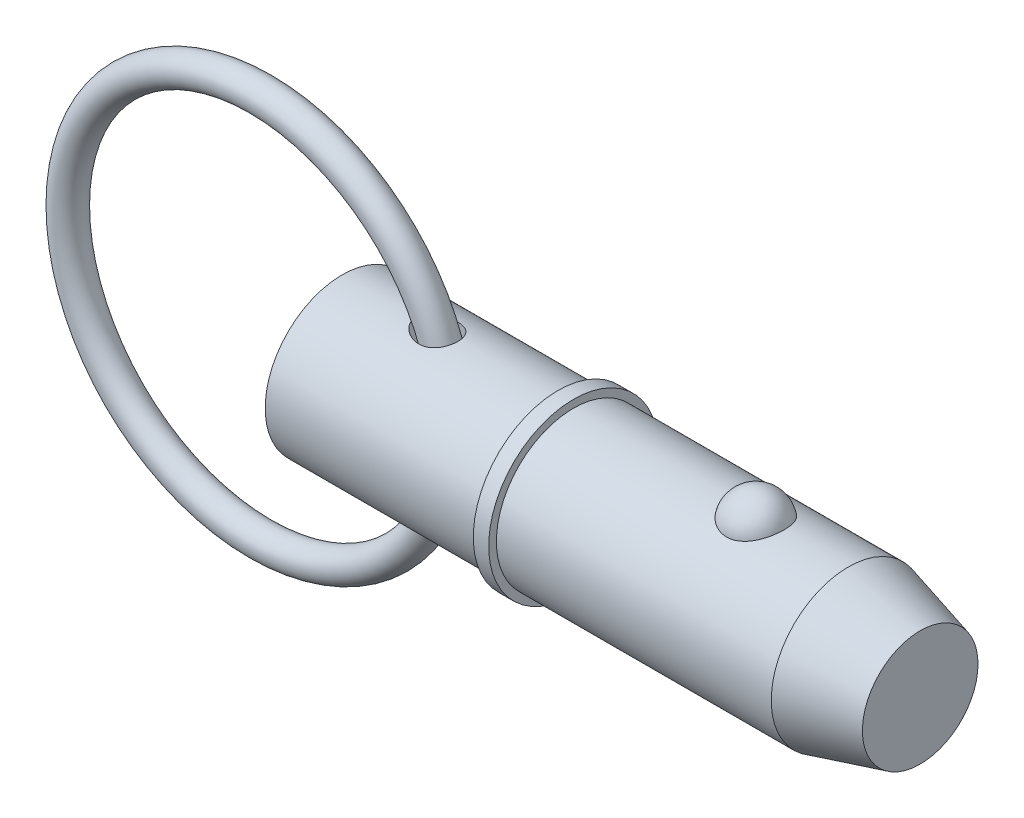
ISO-10303-21;
HEADER;
FILE_DESCRIPTION(('STEP AP214'),'2;1');
FILE_NAME('part.step','',(''),(''),'','','');
FILE_SCHEMA(('AUTOMOTIVE_DESIGN { 1 0 10303 214 1 1 1 1 }'));
ENDSEC;
DATA;
#1=APPLICATION_CONTEXT('core data for automotive mechanical design processes');
#2=APPLICATION_PROTOCOL_DEFINITION('international standard','automotive_design',2000,#1);
#3=PRODUCT_CONTEXT('',#1,'mechanical');
#4=PRODUCT('Part','Part','',(#3));
#5=PRODUCT_RELATED_PRODUCT_CATEGORY('part','',(#4));
#6=PRODUCT_DEFINITION_FORMATION('','',#4);
#7=PRODUCT_DEFINITION_CONTEXT('part definition',#1,'design');
#8=PRODUCT_DEFINITION('design','',#6,#7);
#9=PRODUCT_DEFINITION_SHAPE('','',#8);
#10=(LENGTH_UNIT() NAMED_UNIT(*) SI_UNIT(.MILLI.,.METRE.));
#11=(NAMED_UNIT(*) PLANE_ANGLE_UNIT() SI_UNIT($,.RADIAN.));
#12=(NAMED_UNIT(*) SI_UNIT($,.STERADIAN.) SOLID_ANGLE_UNIT());
#13=UNCERTAINTY_MEASURE_WITH_UNIT(LENGTH_MEASURE(1.E-05),#10,'distance_accuracy_value','');
#14=(GEOMETRIC_REPRESENTATION_CONTEXT(3) GLOBAL_UNCERTAINTY_ASSIGNED_CONTEXT((#13)) GLOBAL_UNIT_ASSIGNED_CONTEXT((#10,
#11,#12)) REPRESENTATION_CONTEXT('',''));
#15=CARTESIAN_POINT('',(0.,0.,0.));
#16=DIRECTION('',(0.,0.,1.));
#17=DIRECTION('',(1.,0.,0.));
#18=AXIS2_PLACEMENT_3D('',#15,#16,#17);
#19=CARTESIAN_POINT('',(-13.4840686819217,0.,0.));
#20=DIRECTION('',(0.,0.,1.));
#21=DIRECTION('',(1.,0.,0.));
#22=AXIS2_PLACEMENT_3D('',#19,#20,#21);
#23=TOROIDAL_SURFACE('',#22,31.75,2.54);
#24=CARTESIAN_POINT('',(20.8059313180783,0.,0.));
#25=VERTEX_POINT('',#24);
#26=VERTEX_LOOP('',#25);
#27=FACE_BOUND('',#26,.T.);
#28=ADVANCED_FACE('P0_F12',(#27),#23,.T.);
#29=CLOSED_SHELL('',(#28));
#30=MANIFOLD_SOLID_BREP('P0_B1',#29);
#31=CARTESIAN_POINT('',(0.,0.,0.));
#32=DIRECTION('',(1.,0.,0.));
#33=DIRECTION('',(0.,0.,-1.));
#34=AXIS2_PLACEMENT_3D('',#31,#32,#33);
#35=CYLINDRICAL_SURFACE('',#34,12.7);
#36=CARTESIAN_POINT('',(13.092900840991,12.5230976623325,-2.11234992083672));
#37=CARTESIAN_POINT('',(13.2535855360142,12.4976398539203,-2.26328363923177));
#38=CARTESIAN_POINT('',(13.4280602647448,12.4718592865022,-2.3995578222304));
#39=CARTESIAN_POINT('',(13.7976341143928,12.4229301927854,-2.64122157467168));
#40=CARTESIAN_POINT('',(13.9927568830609,12.3997847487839,-2.74657519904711));
#41=CARTESIAN_POINT('',(14.397672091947,12.3590534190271,-2.92439761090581));
#42=CARTESIAN_POINT('',(14.6074445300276,12.3414601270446,-2.99691026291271));
#43=CARTESIAN_POINT('',(15.0366557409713,12.3142893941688,-3.10669649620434));
#44=CARTESIAN_POINT('',(15.2560902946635,12.3047084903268,-3.14398530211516));
#45=CARTESIAN_POINT('',(15.5877843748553,12.2976819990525,-3.17128282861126));
#46=CARTESIAN_POINT('',(15.6989364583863,12.2965677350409,-3.17559470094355));
#47=CARTESIAN_POINT('',(15.9211629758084,12.2969101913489,-3.17427486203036));
#48=CARTESIAN_POINT('',(16.0322374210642,12.2983656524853,-3.16864802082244));
#49=CARTESIAN_POINT('',(16.2532861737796,12.3038832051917,-3.14715368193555));
#50=CARTESIAN_POINT('',(16.363260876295,12.3079443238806,-3.13129000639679));
#51=CARTESIAN_POINT('',(16.5810669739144,12.3185954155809,-3.08912320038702));
#52=CARTESIAN_POINT('',(16.6888986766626,12.3251850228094,-3.06282157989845));
#53=CARTESIAN_POINT('',(16.8894247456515,12.3398294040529,-3.00323791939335));
#54=CARTESIAN_POINT('',(16.9824664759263,12.3476389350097,-2.97106098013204));
#55=CARTESIAN_POINT('',(17.1651267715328,12.3648759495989,-2.89848824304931));
#56=CARTESIAN_POINT('',(17.2547457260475,12.3743032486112,-2.85809338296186));
#57=CARTESIAN_POINT('',(17.4297224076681,12.3944822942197,-2.76927391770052));
#58=CARTESIAN_POINT('',(17.5150817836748,12.40523352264,-2.72085245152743));
#59=CARTESIAN_POINT('',(17.6807665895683,12.4277046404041,-2.61629867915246));
#60=CARTESIAN_POINT('',(17.7610923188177,12.4394244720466,-2.56016683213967));
#61=CARTESIAN_POINT('',(17.9797287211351,12.4733252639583,-2.39133767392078));
#62=CARTESIAN_POINT('',(18.1114611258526,12.4961902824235,-2.27005507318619));
#63=CARTESIAN_POINT('',(18.3518677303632,12.5412050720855,-2.00648954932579));
#64=CARTESIAN_POINT('',(18.4605454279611,12.5633549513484,-1.86420981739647));
#65=CARTESIAN_POINT('',(18.6498843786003,12.6039384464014,-1.56614816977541));
#66=CARTESIAN_POINT('',(18.7311185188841,12.622444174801,-1.41073996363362));
#67=CARTESIAN_POINT('',(18.8669149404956,12.6543302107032,-1.08819514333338));
#68=CARTESIAN_POINT('',(18.921477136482,12.6677105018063,-0.921058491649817));
#69=CARTESIAN_POINT('',(19.0028875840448,12.6879542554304,-0.579029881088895));
#70=CARTESIAN_POINT('',(19.0296164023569,12.6947896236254,-0.404107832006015));
#71=CARTESIAN_POINT('',(19.0543673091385,12.7011128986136,-0.0521104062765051));
#72=CARTESIAN_POINT('',(19.0523885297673,12.7006005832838,0.124965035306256));
#73=CARTESIAN_POINT('',(19.019700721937,12.692266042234,0.476969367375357));
#74=CARTESIAN_POINT('',(18.9888798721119,12.6844153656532,0.651887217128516));
#75=CARTESIAN_POINT('',(18.8990221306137,12.6622099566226,0.99389064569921));
#76=CARTESIAN_POINT('',(18.839985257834,12.6478552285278,1.16097622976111));
#77=CARTESIAN_POINT('',(18.6951419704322,12.6142309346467,1.48231767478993));
#78=CARTESIAN_POINT('',(18.6093706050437,12.5949678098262,1.63659000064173));
#79=CARTESIAN_POINT('',(18.4131352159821,12.5536490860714,1.92810749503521));
#80=CARTESIAN_POINT('',(18.3026732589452,12.5315937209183,2.06535408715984));
#81=CARTESIAN_POINT('',(18.060669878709,12.4872833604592,2.31822774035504));
#82=CARTESIAN_POINT('',(17.9292520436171,12.4650302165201,2.43397343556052));
#83=CARTESIAN_POINT('',(17.6485957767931,12.4226514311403,2.64178289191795));
#84=CARTESIAN_POINT('',(17.4993587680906,12.4025256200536,2.73384854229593));
#85=CARTESIAN_POINT('',(17.1869531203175,12.3664726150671,2.8925825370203));
#86=CARTESIAN_POINT('',(17.0237450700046,12.3505578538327,2.95917592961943));
#87=CARTESIAN_POINT('',(16.6884731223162,12.3245177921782,3.06582547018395));
#88=CARTESIAN_POINT('',(16.516407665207,12.3143935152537,3.10587692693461));
#89=CARTESIAN_POINT('',(16.1604213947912,12.3003788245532,3.16093927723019));
#90=CARTESIAN_POINT('',(15.9763106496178,12.2967791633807,3.17478342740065));
#91=CARTESIAN_POINT('',(15.6080973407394,12.2966663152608,3.17521180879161));
#92=CARTESIAN_POINT('',(15.4239948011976,12.3001555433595,3.16178674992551));
#93=CARTESIAN_POINT('',(15.0417156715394,12.3141744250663,3.10676725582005));
#94=CARTESIAN_POINT('',(14.8439465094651,12.3253658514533,3.06251977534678));
#95=CARTESIAN_POINT('',(14.4574652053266,12.3538942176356,2.94531863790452));
#96=CARTESIAN_POINT('',(14.2687614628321,12.3712367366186,2.87233891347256));
#97=CARTESIAN_POINT('',(13.8856104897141,12.4121323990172,2.69045747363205));
#98=CARTESIAN_POINT('',(13.6926012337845,12.4361434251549,2.57861276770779));
#99=CARTESIAN_POINT('',(13.328588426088,12.4862632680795,2.32379935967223));
#100=CARTESIAN_POINT('',(13.1575718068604,12.5123708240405,2.18084927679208));
#101=CARTESIAN_POINT('',(12.8776146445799,12.5579467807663,1.89840233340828));
#102=CARTESIAN_POINT('',(12.7631663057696,12.5776642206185,1.76440341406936));
#103=CARTESIAN_POINT('',(12.5574911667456,12.6143643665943,1.47931295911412));
#104=CARTESIAN_POINT('',(12.4662309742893,12.6313509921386,1.32824646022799));
#105=CARTESIAN_POINT('',(12.3240650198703,12.6583901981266,1.03598403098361));
#106=CARTESIAN_POINT('',(12.2691183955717,12.6691064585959,0.896822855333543));
#107=CARTESIAN_POINT('',(12.1828741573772,12.6860954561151,0.611068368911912));
#108=CARTESIAN_POINT('',(12.1515620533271,12.6923709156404,0.464479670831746));
#109=CARTESIAN_POINT('',(12.1147168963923,12.6997676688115,0.167420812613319));
#110=CARTESIAN_POINT('',(12.1092708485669,12.7008715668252,0.0169392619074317));
#111=CARTESIAN_POINT('',(12.1248234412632,12.6977391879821,-0.282592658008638));
#112=CARTESIAN_POINT('',(12.1458245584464,12.6935024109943,-0.431642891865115));
#113=CARTESIAN_POINT('',(12.210908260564,12.6805581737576,-0.716008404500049));
#114=CARTESIAN_POINT('',(12.2537133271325,12.6720986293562,-0.851633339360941));
#115=CARTESIAN_POINT('',(12.3591295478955,12.6516826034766,-1.11460776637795));
#116=CARTESIAN_POINT('',(12.4217455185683,12.6397252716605,-1.24195523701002));
#117=CARTESIAN_POINT('',(12.5735635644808,12.61152213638,-1.50300095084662));
#118=CARTESIAN_POINT('',(12.6652159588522,12.5949150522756,-1.63522875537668));
#119=CARTESIAN_POINT('',(12.8664347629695,12.5599626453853,-1.88501670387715));
#120=CARTESIAN_POINT('',(12.9760196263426,12.541615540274,-2.0025615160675));
#121=CARTESIAN_POINT('',(13.092900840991,12.5230976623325,-2.11234992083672));
#122=B_SPLINE_CURVE_WITH_KNOTS('',3,(#36,#37,#38,#39,#40,#41,#42,#43,#44,#45,#46,#47,#48,#49,
#50,#51,#52,#53,#54,#55,#56,#57,#58,#59,#60,#61,#62,#63,#64,#65,#66,#67,#68,#69,#70,#71,#72,#73,
#74,#75,#76,#77,#78,#79,#80,#81,#82,#83,#84,#85,#86,#87,#88,#89,#90,#91,#92,#93,#94,#95,#96,#97,
#98,#99,#100,#101,#102,#103,#104,#105,#106,#107,#108,#109,#110,#111,#112,#113,#114,#115,#116,
#117,#118,#119,#120,#121),.UNSPECIFIED.,.T.,.F.,(4,2,2,2,2,2,2,2,2,2,2,2,2,2,2,2,2,2,2,2,2,2,2,
2,2,2,2,2,2,2,2,2,2,2,2,2,2,2,2,2,2,2,4),(0.,0.665132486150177,1.33103515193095,
1.99604575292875,2.66076878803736,2.99410229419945,3.32727250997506,3.66031840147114,
3.99331613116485,4.28918991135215,4.58502994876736,4.88075456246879,5.17646157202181,
5.71510826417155,6.2536731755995,6.78017774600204,7.30668400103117,7.83544030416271,
8.36421259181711,8.89504347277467,9.42587399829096,9.95601150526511,10.4861046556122,
11.0131799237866,11.5402131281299,12.0687854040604,12.5974510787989,13.1491450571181,
13.7010270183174,14.3074556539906,14.914435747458,15.5844380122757,16.2540403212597,
16.7839879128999,17.3131679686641,17.7612578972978,18.2090728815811,18.658393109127,
19.1077554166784,19.5333866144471,19.959121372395,20.4424347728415,20.9262486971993),.UNSPECIFIED.);
#123=CARTESIAN_POINT('',(13.092900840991,12.5230976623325,-2.11234992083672));
#124=VERTEX_POINT('',#123);
#125=EDGE_CURVE('P1_E42',#124,#124,#122,.T.);
#126=ORIENTED_EDGE('',*,*,#125,.T.);
#127=EDGE_LOOP('',(#126));
#128=FACE_BOUND('',#127,.T.);
#129=CARTESIAN_POINT('',(0.,0.,0.));
#130=DIRECTION('',(1.,0.,0.));
#131=DIRECTION('',(0.,0.,-1.));
#132=AXIS2_PLACEMENT_3D('',#129,#130,#131);
#133=CIRCLE('',#132,12.7);
#134=CARTESIAN_POINT('',(0.,0.,-12.7));
#135=VERTEX_POINT('',#134);
#136=EDGE_CURVE('P1_E9',#135,#135,#133,.T.);
#137=ORIENTED_EDGE('',*,*,#136,.T.);
#138=EDGE_LOOP('',(#137));
#139=FACE_BOUND('',#138,.T.);
#140=CARTESIAN_POINT('',(35.56,0.,0.));
#141=DIRECTION('',(1.,0.,0.));
#142=DIRECTION('',(0.,0.,-1.));
#143=AXIS2_PLACEMENT_3D('',#140,#141,#142);
#144=CIRCLE('',#143,12.7);
#145=CARTESIAN_POINT('',(35.56,0.,-12.7));
#146=VERTEX_POINT('',#145);
#147=EDGE_CURVE('P1_E25',#146,#146,#144,.T.);
#148=ORIENTED_EDGE('',*,*,#147,.F.);
#149=EDGE_LOOP('',(#148));
#150=FACE_BOUND('',#149,.T.);
#151=CARTESIAN_POINT('',(13.092900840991,-12.5230976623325,-2.11234992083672));
#152=CARTESIAN_POINT('',(12.9659872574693,-12.5432050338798,-1.99314161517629));
#153=CARTESIAN_POINT('',(12.847667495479,-12.5631124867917,-1.86478966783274));
#154=CARTESIAN_POINT('',(12.6324721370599,-12.6007427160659,-1.59069749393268));
#155=CARTESIAN_POINT('',(12.5355833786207,-12.6184668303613,-1.444968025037));
#156=CARTESIAN_POINT('',(12.409907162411,-12.642034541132,-1.21450950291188));
#157=CARTESIAN_POINT('',(12.3711427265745,-12.6494175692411,-1.13527163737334));
#158=CARTESIAN_POINT('',(12.3010994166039,-12.6628962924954,-0.973464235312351));
#159=CARTESIAN_POINT('',(12.2698164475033,-12.6689926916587,-0.890896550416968));
#160=CARTESIAN_POINT('',(12.2153933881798,-12.6796767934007,-0.723090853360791));
#161=CARTESIAN_POINT('',(12.192246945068,-12.6842656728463,-0.637854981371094));
#162=CARTESIAN_POINT('',(12.154603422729,-12.6917620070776,-0.465421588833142));
#163=CARTESIAN_POINT('',(12.1401047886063,-12.69466976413,-0.378224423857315));
#164=CARTESIAN_POINT('',(12.1214471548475,-12.6984180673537,-0.214417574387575));
#165=CARTESIAN_POINT('',(12.1161713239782,-12.699481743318,-0.137938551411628));
#166=CARTESIAN_POINT('',(12.1124989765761,-12.7002217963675,0.0152189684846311));
#167=CARTESIAN_POINT('',(12.1141046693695,-12.6998977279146,0.0918975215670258));
#168=CARTESIAN_POINT('',(12.1241695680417,-12.6978712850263,0.24474645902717));
#169=CARTESIAN_POINT('',(12.132625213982,-12.6961696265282,0.320917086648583));
#170=CARTESIAN_POINT('',(12.1562110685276,-12.6914452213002,0.472185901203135));
#171=CARTESIAN_POINT('',(12.1713438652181,-12.6884219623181,0.547283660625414));
#172=CARTESIAN_POINT('',(12.223731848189,-12.6780227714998,0.759415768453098));
#173=CARTESIAN_POINT('',(12.268839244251,-12.6691353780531,0.894507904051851));
#174=CARTESIAN_POINT('',(12.3786059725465,-12.6479567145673,1.1560647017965));
#175=CARTESIAN_POINT('',(12.4432700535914,-12.6356646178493,1.28252725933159));
#176=CARTESIAN_POINT('',(12.5971341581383,-12.607236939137,1.5381272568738));
#177=CARTESIAN_POINT('',(12.6882234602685,-12.5908303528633,1.66609325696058));
#178=CARTESIAN_POINT('',(12.887209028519,-12.5564642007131,1.90792082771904));
#179=CARTESIAN_POINT('',(12.995115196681,-12.5385037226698,2.02177401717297));
#180=CARTESIAN_POINT('',(13.2471335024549,-12.4987806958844,2.25547266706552));
#181=CARTESIAN_POINT('',(13.3941979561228,-12.4769622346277,2.3721269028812));
#182=CARTESIAN_POINT('',(13.7036983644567,-12.4349587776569,2.58329351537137));
#183=CARTESIAN_POINT('',(13.8661464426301,-12.4147750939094,2.67778822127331));
#184=CARTESIAN_POINT('',(14.2306024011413,-12.3748157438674,2.85722657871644));
#185=CARTESIAN_POINT('',(14.4347220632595,-12.3556533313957,2.93804226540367));
#186=CARTESIAN_POINT('',(14.8540416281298,-12.3245430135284,3.06594877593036));
#187=CARTESIAN_POINT('',(15.0692453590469,-12.3125976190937,3.11302786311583));
#188=CARTESIAN_POINT('',(15.3981213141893,-12.3014943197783,3.15648626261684));
#189=CARTESIAN_POINT('',(15.5100235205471,-12.298940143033,3.16639841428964));
#190=CARTESIAN_POINT('',(15.7342812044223,-12.2963942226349,3.17627668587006));
#191=CARTESIAN_POINT('',(15.8466364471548,-12.2964012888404,3.1762474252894));
#192=CARTESIAN_POINT('',(16.0707903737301,-12.2990694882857,3.16589868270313));
#193=CARTESIAN_POINT('',(16.1825892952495,-12.3017293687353,3.1555840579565));
#194=CARTESIAN_POINT('',(16.4046123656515,-12.3096862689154,3.12440163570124));
#195=CARTESIAN_POINT('',(16.514836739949,-12.314982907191,3.10353536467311));
#196=CARTESIAN_POINT('',(16.7211934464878,-12.3273933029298,3.05384263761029));
#197=CARTESIAN_POINT('',(16.8175961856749,-12.3342598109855,3.0260738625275));
#198=CARTESIAN_POINT('',(17.0073515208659,-12.3498131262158,2.96195947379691));
#199=CARTESIAN_POINT('',(17.100704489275,-12.3584997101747,2.92561491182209));
#200=CARTESIAN_POINT('',(17.2834584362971,-12.3774243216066,2.84448580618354));
#201=CARTESIAN_POINT('',(17.3728610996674,-12.3876616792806,2.79970490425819));
#202=CARTESIAN_POINT('',(17.5469061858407,-12.409352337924,2.701939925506));
#203=CARTESIAN_POINT('',(17.6315489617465,-12.4208055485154,2.64895645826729));
#204=CARTESIAN_POINT('',(17.7872886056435,-12.4433734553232,2.54070972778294));
#205=CARTESIAN_POINT('',(17.8589017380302,-12.4544123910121,2.48617167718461));
#206=CARTESIAN_POINT('',(17.9970802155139,-12.4768404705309,2.37105291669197));
#207=CARTESIAN_POINT('',(18.063643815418,-12.4882297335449,2.31047013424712));
#208=CARTESIAN_POINT('',(18.1911677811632,-12.5110137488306,2.18372894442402));
#209=CARTESIAN_POINT('',(18.2521311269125,-12.5224084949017,2.11757353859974));
#210=CARTESIAN_POINT('',(18.3680676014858,-12.5448751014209,1.98014449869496));
#211=CARTESIAN_POINT('',(18.4230385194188,-12.5559468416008,1.90886899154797));
#212=CARTESIAN_POINT('',(18.5752306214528,-12.5875288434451,1.69257698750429));
#213=CARTESIAN_POINT('',(18.6637018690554,-12.6071482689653,1.54111740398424));
#214=CARTESIAN_POINT('',(18.8143485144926,-12.6417556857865,1.225260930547));
#215=CARTESIAN_POINT('',(18.876524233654,-12.6567437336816,1.06086419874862));
#216=CARTESIAN_POINT('',(18.9733884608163,-12.6805238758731,0.723195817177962));
#217=CARTESIAN_POINT('',(19.0079967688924,-12.6892978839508,0.549899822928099));
#218=CARTESIAN_POINT('',(19.0486500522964,-12.6996362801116,0.199781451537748));
#219=CARTESIAN_POINT('',(19.054694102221,-12.7012004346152,0.0229589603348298));
#220=CARTESIAN_POINT('',(19.0380549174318,-12.6969431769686,-0.330044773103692));
#221=CARTESIAN_POINT('',(19.0152419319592,-12.6910884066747,-0.506219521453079));
#222=CARTESIAN_POINT('',(18.9411599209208,-12.672565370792,-0.852112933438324));
#223=CARTESIAN_POINT('',(18.8898907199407,-12.659897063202,-1.0218315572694));
#224=CARTESIAN_POINT('',(18.7600888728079,-12.6291327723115,-1.34987035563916));
#225=CARTESIAN_POINT('',(18.6815715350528,-12.6110398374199,-1.50819687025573));
#226=CARTESIAN_POINT('',(18.4991526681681,-12.5714188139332,-1.808997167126));
#227=CARTESIAN_POINT('',(18.3952529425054,-12.5498909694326,-1.95147207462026));
#228=CARTESIAN_POINT('',(18.1653806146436,-12.5059234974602,-2.21580059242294));
#229=CARTESIAN_POINT('',(18.0395297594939,-12.4834893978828,-2.33776101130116));
#230=CARTESIAN_POINT('',(17.7688701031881,-12.4400863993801,-2.55870399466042));
#231=CARTESIAN_POINT('',(17.6240631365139,-12.4191173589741,-2.65768878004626));
#232=CARTESIAN_POINT('',(17.3196803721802,-12.380896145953,-2.8304192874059));
#233=CARTESIAN_POINT('',(17.1601036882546,-12.3636441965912,-2.90416349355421));
#234=CARTESIAN_POINT('',(16.8308162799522,-12.3345597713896,-3.02531546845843));
#235=CARTESIAN_POINT('',(16.6611041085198,-12.322728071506,-3.07271946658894));
#236=CARTESIAN_POINT('',(16.3099674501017,-12.3051318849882,-3.14246490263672));
#237=CARTESIAN_POINT('',(16.1283412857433,-12.2996014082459,-3.16384159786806));
#238=CARTESIAN_POINT('',(15.7639014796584,-12.2955807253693,-3.17942379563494));
#239=CARTESIAN_POINT('',(15.5810875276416,-12.2970924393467,-3.17362188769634));
#240=CARTESIAN_POINT('',(15.20154276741,-12.307074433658,-3.13470416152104));
#241=CARTESIAN_POINT('',(15.0050835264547,-12.316173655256,-3.09911848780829));
#242=CARTESIAN_POINT('',(14.6197996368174,-12.3407987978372,-2.99954607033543));
#243=CARTESIAN_POINT('',(14.4309834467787,-12.3563316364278,-2.93552875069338));
#244=CARTESIAN_POINT('',(14.0353751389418,-12.3949378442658,-2.76840280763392));
#245=CARTESIAN_POINT('',(13.8306109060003,-12.4188242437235,-2.66064798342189));
#246=CARTESIAN_POINT('',(13.4432099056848,-12.4696241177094,-2.4113475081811));
#247=CARTESIAN_POINT('',(13.2605568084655,-12.4965353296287,-2.26982702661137));
#248=CARTESIAN_POINT('',(13.092900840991,-12.5230976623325,-2.11234992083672));
#249=B_SPLINE_CURVE_WITH_KNOTS('',3,(#151,#152,#153,#154,#155,#156,#157,#158,#159,#160,#161,
#162,#163,#164,#165,#166,#167,#168,#169,#170,#171,#172,#173,#174,#175,#176,#177,#178,#179,#180,
#181,#182,#183,#184,#185,#186,#187,#188,#189,#190,#191,#192,#193,#194,#195,#196,#197,#198,#199,
#200,#201,#202,#203,#204,#205,#206,#207,#208,#209,#210,#211,#212,#213,#214,#215,#216,#217,#218,
#219,#220,#221,#222,#223,#224,#225,#226,#227,#228,#229,#230,#231,#232,#233,#234,#235,#236,#237,
#238,#239,#240,#241,#242,#243,#244,#245,#246,#247,#248),.UNSPECIFIED.,.T.,.F.,(4,2,2,2,2,2,2,2,
2,2,2,2,2,2,2,2,2,2,2,2,2,2,2,2,2,2,2,2,2,2,2,2,2,2,2,2,2,2,2,2,2,2,2,2,2,2,2,2,4),(0.,
0.525289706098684,1.05025590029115,1.31549608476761,1.58059075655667,1.84547798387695,
2.11031756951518,2.34000998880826,2.56977615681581,2.79942299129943,3.0291589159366,
3.45531787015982,3.8815803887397,4.35362362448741,4.82594586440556,5.39074449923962,
5.95599200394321,6.61421946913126,7.27267581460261,7.60939383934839,7.9459554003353,
8.2823580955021,8.61871213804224,8.91997243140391,9.22119579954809,9.52228943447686,
9.82336070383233,10.0950952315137,10.3669232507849,10.6386057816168,10.9103882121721,
11.4371688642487,11.9639430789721,12.4922442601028,13.0205625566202,13.5512648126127,
14.0819703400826,14.6123781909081,15.1427483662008,15.6702654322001,16.1977314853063,
16.7252292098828,17.2528024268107,17.7993878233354,18.3461222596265,18.9432829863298,
19.541087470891,20.2355241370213,20.9294447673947),.UNSPECIFIED.);
#250=CARTESIAN_POINT('',(13.092900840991,-12.5230976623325,-2.11234992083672));
#251=VERTEX_POINT('',#250);
#252=EDGE_CURVE('P1_E17',#251,#251,#249,.T.);
#253=ORIENTED_EDGE('',*,*,#252,.T.);
#254=EDGE_LOOP('',(#253));
#255=FACE_BOUND('',#254,.T.);
#256=ADVANCED_FACE('P1_F13',(#128,#139,#150,#255),#35,.T.);
#257=CARTESIAN_POINT('',(0.,0.,0.));
#258=DIRECTION('',(1.,0.,0.));
#259=DIRECTION('',(0.,0.,-1.));
#260=AXIS2_PLACEMENT_3D('',#257,#258,#259);
#261=CYLINDRICAL_SURFACE('',#260,12.7);
#262=CARTESIAN_POINT('',(83.4007386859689,0.,0.));
#263=DIRECTION('',(1.,0.,0.));
#264=DIRECTION('',(0.,0.,-1.));
#265=AXIS2_PLACEMENT_3D('',#262,#263,#264);
#266=CIRCLE('',#265,12.7);
#267=CARTESIAN_POINT('',(83.4007386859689,0.,-12.7));
#268=VERTEX_POINT('',#267);
#269=EDGE_CURVE('P1_E99',#268,#268,#266,.T.);
#270=ORIENTED_EDGE('',*,*,#269,.F.);
#271=EDGE_LOOP('',(#270));
#272=FACE_BOUND('',#271,.T.);
#273=CARTESIAN_POINT('',(38.1,0.,0.));
#274=DIRECTION('',(1.,0.,0.));
#275=DIRECTION('',(0.,0.,-1.));
#276=AXIS2_PLACEMENT_3D('',#273,#274,#275);
#277=CIRCLE('',#276,12.7);
#278=CARTESIAN_POINT('',(38.1,0.,-12.7));
#279=VERTEX_POINT('',#278);
#280=EDGE_CURVE('P1_E96',#279,#279,#277,.T.);
#281=ORIENTED_EDGE('',*,*,#280,.T.);
#282=EDGE_LOOP('',(#281));
#283=FACE_BOUND('',#282,.T.);
#284=CARTESIAN_POINT('',(68.1600429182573,11.7500437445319,4.81938502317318));
#285=CARTESIAN_POINT('',(68.0350881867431,11.7500430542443,4.81938571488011));
#286=CARTESIAN_POINT('',(67.910144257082,11.7520975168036,4.81438658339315));
#287=CARTESIAN_POINT('',(67.6611425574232,11.760253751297,4.79442904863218));
#288=CARTESIAN_POINT('',(67.5370850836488,11.7663568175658,4.77946746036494));
#289=CARTESIAN_POINT('',(67.2909016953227,11.7824262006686,4.7397141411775));
#290=CARTESIAN_POINT('',(67.1687744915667,11.7923898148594,4.71492928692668));
#291=CARTESIAN_POINT('',(66.9271874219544,11.8158938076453,4.65571340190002));
#292=CARTESIAN_POINT('',(66.8077285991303,11.8294355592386,4.6212786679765));
#293=CARTESIAN_POINT('',(66.5725578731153,11.8596812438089,4.54309502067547));
#294=CARTESIAN_POINT('',(66.4568393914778,11.8763792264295,4.49936361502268));
#295=CARTESIAN_POINT('',(66.2296530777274,11.9124878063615,4.40287235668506));
#296=CARTESIAN_POINT('',(66.1181868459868,11.9318994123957,4.35010914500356));
#297=CARTESIAN_POINT('',(65.7912782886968,11.9934256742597,4.17881316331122));
#298=CARTESIAN_POINT('',(65.5831270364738,12.038858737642,4.04720756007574));
#299=CARTESIAN_POINT('',(65.1858509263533,12.1352173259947,3.748564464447));
#300=CARTESIAN_POINT('',(64.9974438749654,12.1862630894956,3.58061821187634));
#301=CARTESIAN_POINT('',(64.6505213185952,12.2875163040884,3.21600758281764));
#302=CARTESIAN_POINT('',(64.4920113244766,12.3377235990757,3.0193379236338));
#303=CARTESIAN_POINT('',(64.2016887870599,12.434492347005,2.592916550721));
#304=CARTESIAN_POINT('',(64.0713762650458,12.4807925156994,2.36208286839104));
#305=CARTESIAN_POINT('',(63.8494079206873,12.5623454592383,1.88070399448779));
#306=CARTESIAN_POINT('',(63.7577554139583,12.5975972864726,1.63015711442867));
#307=CARTESIAN_POINT('',(63.6140466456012,12.6538414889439,1.1129886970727));
#308=CARTESIAN_POINT('',(63.5624990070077,12.6746503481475,0.846205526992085));
#309=CARTESIAN_POINT('',(63.5019771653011,12.699153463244,0.307085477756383));
#310=CARTESIAN_POINT('',(63.4930018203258,12.7028481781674,0.0347487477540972));
#311=CARTESIAN_POINT('',(63.5177310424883,12.6927785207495,-0.506073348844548));
#312=CARTESIAN_POINT('',(63.5511899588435,12.6791146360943,-0.77457186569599));
#313=CARTESIAN_POINT('',(63.6596877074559,12.635882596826,-1.30170246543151));
#314=CARTESIAN_POINT('',(63.7347272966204,12.606314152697,-1.5603343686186));
#315=CARTESIAN_POINT('',(63.9250000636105,12.5342328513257,-2.06083899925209));
#316=CARTESIAN_POINT('',(64.0402872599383,12.4917026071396,-2.3026886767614));
#317=CARTESIAN_POINT('',(64.3087044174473,12.3981123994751,-2.76259600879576));
#318=CARTESIAN_POINT('',(64.4618374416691,12.3470517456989,-2.98065173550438));
#319=CARTESIAN_POINT('',(64.8035077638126,12.2416045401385,-3.38786328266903));
#320=CARTESIAN_POINT('',(64.9922017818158,12.1872040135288,-3.57688418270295));
#321=CARTESIAN_POINT('',(65.4002392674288,12.0814086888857,-3.91941073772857));
#322=CARTESIAN_POINT('',(65.6195800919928,12.0300136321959,-4.07291945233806));
#323=CARTESIAN_POINT('',(66.0783753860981,11.9373542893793,-4.33691289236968));
#324=CARTESIAN_POINT('',(66.3173044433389,11.8958982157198,-4.44824125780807));
#325=CARTESIAN_POINT('',(66.8124376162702,11.8268116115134,-4.62881985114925));
#326=CARTESIAN_POINT('',(67.0686351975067,11.7991758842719,-4.69808589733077));
#327=CARTESIAN_POINT('',(67.5771640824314,11.7622209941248,-4.78983181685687));
#328=CARTESIAN_POINT('',(67.8290414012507,11.7520502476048,-4.81449025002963));
#329=CARTESIAN_POINT('',(68.3335734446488,11.7485796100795,-4.82295735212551));
#330=CARTESIAN_POINT('',(68.5862280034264,11.7552763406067,-4.80677420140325));
#331=CARTESIAN_POINT('',(69.0768341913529,11.7842584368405,-4.73525430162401));
#332=CARTESIAN_POINT('',(69.3149984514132,11.8060486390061,-4.68116061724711));
#333=CARTESIAN_POINT('',(69.7784894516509,11.8622750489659,-4.53678133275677));
#334=CARTESIAN_POINT('',(70.0038151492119,11.8967122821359,-4.44649279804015));
#335=CARTESIAN_POINT('',(70.4408018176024,11.9754603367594,-4.2298761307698));
#336=CARTESIAN_POINT('',(70.6520579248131,12.0199699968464,-4.10280539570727));
#337=CARTESIAN_POINT('',(71.0506012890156,12.1138028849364,-3.81685409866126));
#338=CARTESIAN_POINT('',(71.2378830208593,12.163127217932,-3.65796622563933));
#339=CARTESIAN_POINT('',(71.5933509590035,12.2642343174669,-3.30364864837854));
#340=CARTESIAN_POINT('',(71.7601119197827,12.3160165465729,-3.10678783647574));
#341=CARTESIAN_POINT('',(72.0595799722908,12.4142566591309,-2.68748409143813));
#342=CARTESIAN_POINT('',(72.1922809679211,12.4607135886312,-2.46503658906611));
#343=CARTESIAN_POINT('',(72.4246912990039,12.5450236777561,-1.99289519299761));
#344=CARTESIAN_POINT('',(72.523215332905,12.5825557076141,-1.74255918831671));
#345=CARTESIAN_POINT('',(72.6792277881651,12.6431720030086,-1.22773734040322));
#346=CARTESIAN_POINT('',(72.7367157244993,12.6662560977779,-0.963251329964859));
#347=CARTESIAN_POINT('',(72.8095441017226,12.6956486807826,-0.427355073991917));
#348=CARTESIAN_POINT('',(72.8248378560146,12.7019385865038,-0.1559374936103));
#349=CARTESIAN_POINT('',(72.8127794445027,12.6970201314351,0.385928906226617));
#350=CARTESIAN_POINT('',(72.7854280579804,12.6858120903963,0.656377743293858));
#351=CARTESIAN_POINT('',(72.7130609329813,12.6568455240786,1.05454017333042));
#352=CARTESIAN_POINT('',(72.6837963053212,12.6451962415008,1.18577850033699));
#353=CARTESIAN_POINT('',(72.6150228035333,12.6181819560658,1.4451380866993));
#354=CARTESIAN_POINT('',(72.5755176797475,12.6028183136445,1.57326046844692));
#355=CARTESIAN_POINT('',(72.4864397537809,12.5687547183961,1.82554978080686));
#356=CARTESIAN_POINT('',(72.4368627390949,12.5500533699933,1.9497150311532));
#357=CARTESIAN_POINT('',(72.3279211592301,12.5098093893,2.1931437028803));
#358=CARTESIAN_POINT('',(72.2685601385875,12.4882677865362,2.31240887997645));
#359=CARTESIAN_POINT('',(72.1399712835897,12.4427679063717,2.54593031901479));
#360=CARTESIAN_POINT('',(72.0706888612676,12.4187964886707,2.66015396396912));
#361=CARTESIAN_POINT('',(71.922903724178,12.3691892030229,2.88202659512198));
#362=CARTESIAN_POINT('',(71.8444044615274,12.3435539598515,2.98967802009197));
#363=CARTESIAN_POINT('',(71.6785502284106,12.2912955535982,3.19774385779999));
#364=CARTESIAN_POINT('',(71.5911918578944,12.2646720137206,3.29815546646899));
#365=CARTESIAN_POINT('',(71.4081617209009,12.2111945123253,3.49095035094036));
#366=CARTESIAN_POINT('',(71.3124932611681,12.1843406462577,3.58333679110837));
#367=CARTESIAN_POINT('',(71.1136272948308,12.1312249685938,3.75922876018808));
#368=CARTESIAN_POINT('',(71.0104503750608,12.104961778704,3.84275713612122));
#369=CARTESIAN_POINT('',(70.7970133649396,12.0537284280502,4.00056406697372));
#370=CARTESIAN_POINT('',(70.6867562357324,12.028757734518,4.07484645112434));
#371=CARTESIAN_POINT('',(70.4597550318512,11.9808306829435,4.21367959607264));
#372=CARTESIAN_POINT('',(70.3430068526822,11.9578756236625,4.27822410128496));
#373=CARTESIAN_POINT('',(70.1039425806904,11.9147184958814,4.39698483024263));
#374=CARTESIAN_POINT('',(69.9816287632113,11.894515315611,4.45120522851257));
#375=CARTESIAN_POINT('',(69.722952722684,11.8561129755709,4.55255353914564));
#376=CARTESIAN_POINT('',(69.5862237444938,11.8381764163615,4.59884858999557));
#377=CARTESIAN_POINT('',(69.3086087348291,11.8069093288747,4.67853897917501));
#378=CARTESIAN_POINT('',(69.1677245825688,11.7935767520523,4.71194005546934));
#379=CARTESIAN_POINT('',(68.8830944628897,11.7720277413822,4.76552188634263));
#380=CARTESIAN_POINT('',(68.7393488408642,11.7638106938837,4.78570422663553));
#381=CARTESIAN_POINT('',(68.4504114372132,11.7528195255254,4.81263433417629));
#382=CARTESIAN_POINT('',(68.3052198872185,11.7500445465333,4.81938421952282));
#383=CARTESIAN_POINT('',(68.1600429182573,11.7500437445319,4.81938502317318));
#384=B_SPLINE_CURVE_WITH_KNOTS('',3,(#284,#285,#286,#287,#288,#289,#290,#291,#292,#293,#294,
#295,#296,#297,#298,#299,#300,#301,#302,#303,#304,#305,#306,#307,#308,#309,#310,#311,#312,#313,
#314,#315,#316,#317,#318,#319,#320,#321,#322,#323,#324,#325,#326,#327,#328,#329,#330,#331,#332,
#333,#334,#335,#336,#337,#338,#339,#340,#341,#342,#343,#344,#345,#346,#347,#348,#349,#350,#351,
#352,#353,#354,#355,#356,#357,#358,#359,#360,#361,#362,#363,#364,#365,#366,#367,#368,#369,#370,
#371,#372,#373,#374,#375,#376,#377,#378,#379,#380,#381,#382,#383),.UNSPECIFIED.,.T.,.F.,(4,2,2,
2,2,2,2,2,2,2,2,2,2,2,2,2,2,2,2,2,2,2,2,2,2,2,2,2,2,2,2,2,2,2,2,2,2,2,2,2,2,2,2,2,2,2,2,2,2,4),
(0.,0.374729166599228,0.749578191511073,1.12416526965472,1.49889629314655,1.87292776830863,
2.24709865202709,2.99481328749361,3.76399449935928,4.53331735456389,5.3368391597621,
6.14042986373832,6.95405296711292,7.76765424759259,8.57656703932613,9.38549455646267,
10.1955119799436,11.0055949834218,11.8193353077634,12.6330054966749,13.4294141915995,
14.2255231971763,14.9815786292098,15.7374826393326,16.4696948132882,17.2019663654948,
17.9501979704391,18.6986017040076,19.484470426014,20.2704797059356,21.0815215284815,
21.8925729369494,22.7045213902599,23.5164550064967,23.9209608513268,24.3253187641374,
24.7298461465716,25.1342272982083,25.54092555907,25.9474719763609,26.3541750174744,
26.7607169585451,27.1661834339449,27.5714814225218,27.9770386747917,28.3824315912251,
28.8181206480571,29.2536155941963,29.6890582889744,30.1244323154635),.UNSPECIFIED.);
#385=CARTESIAN_POINT('',(68.1600429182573,11.7500437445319,4.81938502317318));
#386=VERTEX_POINT('',#385);
#387=EDGE_CURVE('P1_E34',#386,#386,#384,.T.);
#388=ORIENTED_EDGE('',*,*,#387,.T.);
#389=EDGE_LOOP('',(#388));
#390=FACE_BOUND('',#389,.T.);
#391=ADVANCED_FACE('P1_F46',(#272,#283,#390),#261,.T.);
#392=CARTESIAN_POINT('',(0.,0.,0.));
#393=DIRECTION('',(-1.,0.,0.));
#394=DIRECTION('',(0.,0.,1.));
#395=AXIS2_PLACEMENT_3D('',#392,#393,#394);
#396=PLANE('',#395);
#397=ORIENTED_EDGE('',*,*,#136,.F.);
#398=EDGE_LOOP('',(#397));
#399=FACE_BOUND('',#398,.T.);
#400=ADVANCED_FACE('P1_F15',(#399),#396,.T.);
#401=CARTESIAN_POINT('',(35.56,12.7,0.));
#402=DIRECTION('',(-1.,0.,0.));
#403=DIRECTION('',(0.,0.,1.));
#404=AXIS2_PLACEMENT_3D('',#401,#402,#403);
#405=PLANE('',#404);
#406=ORIENTED_EDGE('',*,*,#147,.T.);
#407=EDGE_LOOP('',(#406));
#408=FACE_BOUND('',#407,.T.);
#409=CARTESIAN_POINT('',(35.56,0.,0.));
#410=DIRECTION('',(1.,0.,0.));
#411=DIRECTION('',(0.,0.,-1.));
#412=AXIS2_PLACEMENT_3D('',#409,#410,#411);
#413=CIRCLE('',#412,13.97);
#414=CARTESIAN_POINT('',(35.56,0.,-13.97));
#415=VERTEX_POINT('',#414);
#416=EDGE_CURVE('P1_E30',#415,#415,#413,.T.);
#417=ORIENTED_EDGE('',*,*,#416,.F.);
#418=EDGE_LOOP('',(#417));
#419=FACE_BOUND('',#418,.T.);
#420=ADVANCED_FACE('P1_F81',(#408,#419),#405,.T.);
#421=CARTESIAN_POINT('',(0.,0.,0.));
#422=DIRECTION('',(1.,0.,0.));
#423=DIRECTION('',(0.,0.,-1.));
#424=AXIS2_PLACEMENT_3D('',#421,#422,#423);
#425=CYLINDRICAL_SURFACE('',#424,13.97);
#426=ORIENTED_EDGE('',*,*,#416,.T.);
#427=EDGE_LOOP('',(#426));
#428=FACE_BOUND('',#427,.T.);
#429=CARTESIAN_POINT('',(38.1,0.,0.));
#430=DIRECTION('',(1.,0.,0.));
#431=DIRECTION('',(0.,0.,-1.));
#432=AXIS2_PLACEMENT_3D('',#429,#430,#431);
#433=CIRCLE('',#432,13.97);
#434=CARTESIAN_POINT('',(38.1,0.,-13.97));
#435=VERTEX_POINT('',#434);
#436=EDGE_CURVE('P1_E95',#435,#435,#433,.T.);
#437=ORIENTED_EDGE('',*,*,#436,.F.);
#438=EDGE_LOOP('',(#437));
#439=FACE_BOUND('',#438,.T.);
#440=ADVANCED_FACE('P1_F68',(#428,#439),#425,.T.);
#441=CARTESIAN_POINT('',(38.1,13.97,0.));
#442=DIRECTION('',(1.,0.,0.));
#443=DIRECTION('',(0.,0.,-1.));
#444=AXIS2_PLACEMENT_3D('',#441,#442,#443);
#445=PLANE('',#444);
#446=ORIENTED_EDGE('',*,*,#436,.T.);
#447=EDGE_LOOP('',(#446));
#448=FACE_BOUND('',#447,.T.);
#449=ORIENTED_EDGE('',*,*,#280,.F.);
#450=EDGE_LOOP('',(#449));
#451=FACE_BOUND('',#450,.T.);
#452=ADVANCED_FACE('P1_F62',(#448,#451),#445,.T.);
#453=CARTESIAN_POINT('',(95.25,0.,0.));
#454=DIRECTION('',(-1.,0.,0.));
#455=DIRECTION('',(0.,0.,1.));
#456=AXIS2_PLACEMENT_3D('',#453,#454,#455);
#457=CONICAL_SURFACE('',#456,9.52500000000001,0.26179938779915);
#458=ORIENTED_EDGE('',*,*,#269,.T.);
#459=EDGE_LOOP('',(#458));
#460=FACE_BOUND('',#459,.T.);
#461=CARTESIAN_POINT('',(95.25,0.,0.));
#462=DIRECTION('',(1.,0.,0.));
#463=DIRECTION('',(0.,0.,-1.));
#464=AXIS2_PLACEMENT_3D('',#461,#462,#463);
#465=CIRCLE('',#464,9.52500000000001);
#466=CARTESIAN_POINT('',(95.25,0.,-9.52500000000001));
#467=VERTEX_POINT('',#466);
#468=EDGE_CURVE('P1_E41',#467,#467,#465,.T.);
#469=ORIENTED_EDGE('',*,*,#468,.F.);
#470=EDGE_LOOP('',(#469));
#471=FACE_BOUND('',#470,.T.);
#472=ADVANCED_FACE('P1_F59',(#460,#471),#457,.T.);
#473=CARTESIAN_POINT('',(95.25,9.52500000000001,0.));
#474=DIRECTION('',(1.,0.,0.));
#475=DIRECTION('',(0.,0.,-1.));
#476=AXIS2_PLACEMENT_3D('',#473,#474,#475);
#477=PLANE('',#476);
#478=ORIENTED_EDGE('',*,*,#468,.T.);
#479=EDGE_LOOP('',(#478));
#480=FACE_BOUND('',#479,.T.);
#481=ADVANCED_FACE('P1_F55',(#480),#477,.T.);
#482=CARTESIAN_POINT('',(68.1600429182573,11.43,0.));
#483=DIRECTION('',(-1.,0.,0.));
#484=DIRECTION('',(0.,1.,0.));
#485=AXIS2_PLACEMENT_3D('',#482,#483,#484);
#486=SPHERICAL_SURFACE('',#485,4.83);
#487=ORIENTED_EDGE('',*,*,#387,.F.);
#488=EDGE_LOOP('',(#487));
#489=FACE_BOUND('',#488,.T.);
#490=ADVANCED_FACE('P1_F50',(#489),#486,.T.);
#491=CARTESIAN_POINT('',(-13.4840686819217,0.,0.));
#492=DIRECTION('',(0.,0.,1.));
#493=DIRECTION('',(1.,0.,0.));
#494=AXIS2_PLACEMENT_3D('',#491,#492,#493);
#495=TOROIDAL_SURFACE('',#494,31.75,3.175);
#496=ORIENTED_EDGE('',*,*,#252,.F.);
#497=EDGE_LOOP('',(#496));
#498=FACE_BOUND('',#497,.T.);
#499=ORIENTED_EDGE('',*,*,#125,.F.);
#500=EDGE_LOOP('',(#499));
#501=FACE_BOUND('',#500,.T.);
#502=ADVANCED_FACE('P1_F54',(#498,#501),#495,.F.);
#503=CLOSED_SHELL('',(#256,#391,#400,#420,#440,#452,#472,#481,#490,#502));
#504=MANIFOLD_SOLID_BREP('P1_B1',#503);
#505=ADVANCED_BREP_SHAPE_REPRESENTATION('',(#18,#30,#504),#14);
#506=SHAPE_DEFINITION_REPRESENTATION(#9,#505);
ENDSEC;
END-ISO-10303-21;
